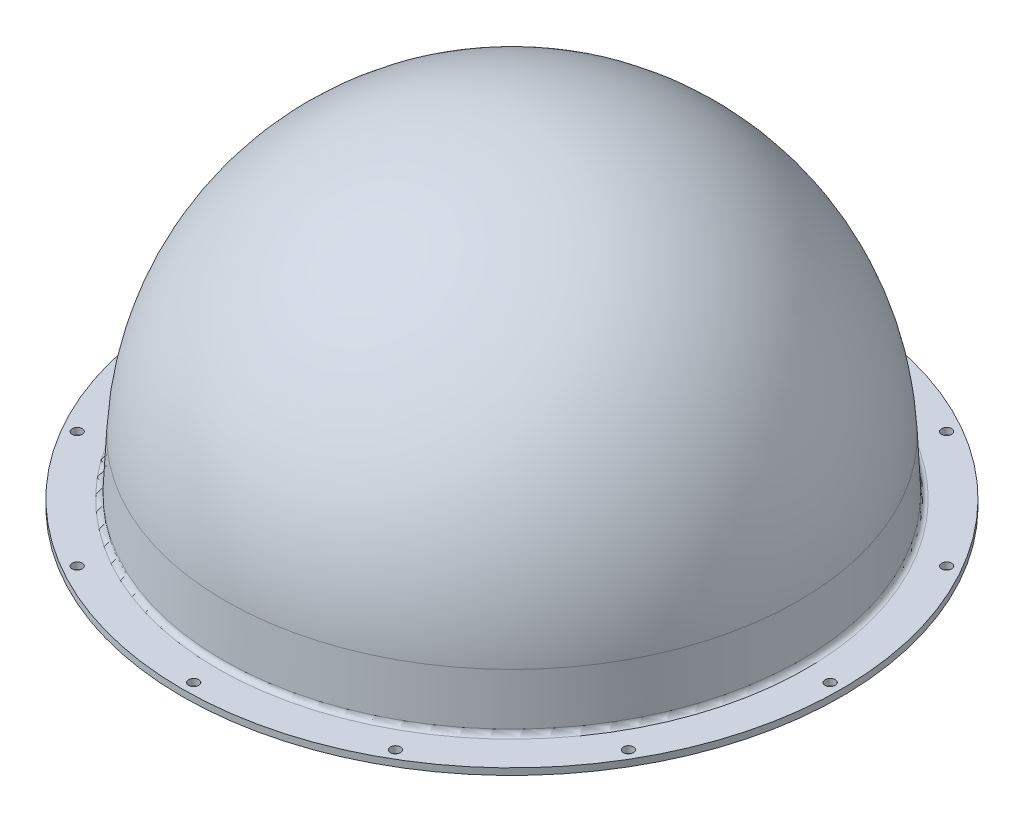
from build123d import *

# Parameters (mm, degrees)
SKETCH3_R          = 1.65
CUT_EXTRUDE1_DEPTH = 188.108680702


with BuildPart() as part:
    # Sketch2 → Revolve1 (revolve)
    with BuildSketch(Plane.XY, mode=Mode.PRIVATE) as revolve1_sk:
        with BuildLine():
            Line((95.193400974, 0), (108.27, 0))
            Line((108.27, 0), (108.27, 2.16))
            Line((108.27, 2.16), (96.705683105, 2.16))
            ThreePointArc((96.705683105, 2.16), (95.522083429, 2.632807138), (94.99, 3.790970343))
            Line((94.99, 3.790970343), (94.159260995, 20.19))
            ThreePointArc((94.159260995, 20.19), (64.957724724, 83.751733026), (0, 109.70009761))
            Line((0, 109.70009761), (0, 106.654867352))
            ThreePointArc((0, 106.654867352), (62.805471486, 81.598024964), (91.114958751, 20.19))
            Line((91.114958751, 20.19), (92.015, 3.016189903))
            ThreePointArc((92.015, 3.016189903), (93.00253161, 0.874068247), (95.193400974, 0))
        make_face()
    revolve(revolve1_sk.sketch.rotate(Axis((0, 0, 0), (0, -1, 0)), 90), axis=Axis((0, 0, 0), (0, -1, 0)))

    # Sketch3 → Cut-Extrude1 (cut, through all)
    with BuildSketch(Plane(origin=(0, 2.16, 0), x_dir=(1, 0, 0), z_dir=(0, 1, 0))):
        with Locations(Location((0, 104.55, 0), (0, 0, 270))):
            Circle(SKETCH3_R)
        with Locations(Location((52.275, 90.542955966, 0), (0, 0, 270))):
            Circle(SKETCH3_R)
        with Locations(Location((90.542955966, 52.275, 0), (0, 0, 270))):
            Circle(SKETCH3_R)
        with Locations(Location((104.55, 0, 0), (0, 0, 270))):
            Circle(SKETCH3_R)
        with Locations(Location((90.542955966, -52.275, 0), (0, 0, 270))):
            Circle(SKETCH3_R)
        with Locations(Location((52.275, -90.542955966, 0), (0, 0, 270))):
            Circle(SKETCH3_R)
        with Locations(Location((0, -104.55, 0), (0, 0, 270))):
            Circle(SKETCH3_R)
        with Locations(Location((-52.275, -90.542955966, 0), (0, 0, 270))):
            Circle(SKETCH3_R)
        with Locations(Location((-90.542955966, -52.275, 0), (0, 0, 270))):
            Circle(SKETCH3_R)
        with Locations(Location((-104.55, 0, 0), (0, 0, 270))):
            Circle(SKETCH3_R)
        with Locations(Location((-90.542955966, 52.275, 0), (0, 0, 270))):
            Circle(SKETCH3_R)
        with Locations(Location((-52.275, 90.542955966, 0), (0, 0, 270))):
            Circle(SKETCH3_R)
    extrude(amount=-CUT_EXTRUDE1_DEPTH, mode=Mode.SUBTRACT)


solid = part.part
